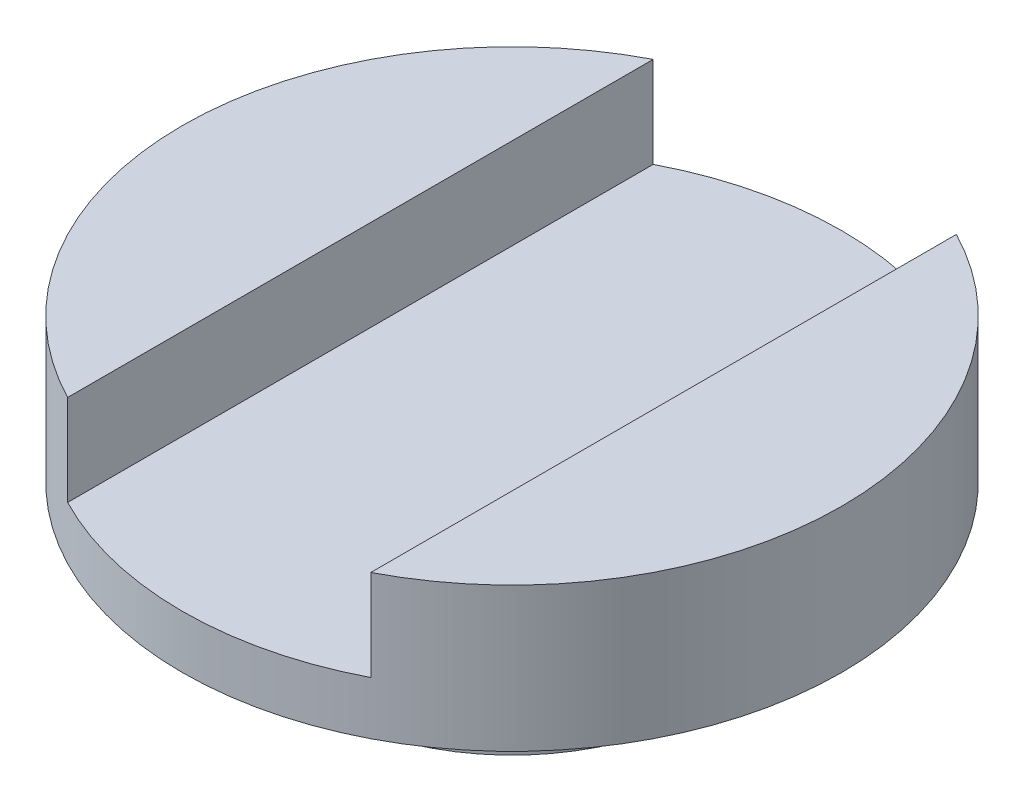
ISO-10303-21;
HEADER;
FILE_DESCRIPTION(('STEP AP214'),'2;1');
FILE_NAME('part.step','',(''),(''),'','','');
FILE_SCHEMA(('AUTOMOTIVE_DESIGN { 1 0 10303 214 1 1 1 1 }'));
ENDSEC;
DATA;
#1=APPLICATION_CONTEXT('core data for automotive mechanical design processes');
#2=APPLICATION_PROTOCOL_DEFINITION('international standard','automotive_design',2000,#1);
#3=PRODUCT_CONTEXT('',#1,'mechanical');
#4=PRODUCT('Part','Part','',(#3));
#5=PRODUCT_RELATED_PRODUCT_CATEGORY('part','',(#4));
#6=PRODUCT_DEFINITION_FORMATION('','',#4);
#7=PRODUCT_DEFINITION_CONTEXT('part definition',#1,'design');
#8=PRODUCT_DEFINITION('design','',#6,#7);
#9=PRODUCT_DEFINITION_SHAPE('','',#8);
#10=(LENGTH_UNIT() NAMED_UNIT(*) SI_UNIT(.MILLI.,.METRE.));
#11=(NAMED_UNIT(*) PLANE_ANGLE_UNIT() SI_UNIT($,.RADIAN.));
#12=(NAMED_UNIT(*) SI_UNIT($,.STERADIAN.) SOLID_ANGLE_UNIT());
#13=UNCERTAINTY_MEASURE_WITH_UNIT(LENGTH_MEASURE(1.E-05),#10,'distance_accuracy_value','');
#14=(GEOMETRIC_REPRESENTATION_CONTEXT(3) GLOBAL_UNCERTAINTY_ASSIGNED_CONTEXT((#13)) GLOBAL_UNIT_ASSIGNED_CONTEXT((#10,
#11,#12)) REPRESENTATION_CONTEXT('',''));
#15=CARTESIAN_POINT('',(0.,0.,0.));
#16=DIRECTION('',(0.,0.,1.));
#17=DIRECTION('',(1.,0.,0.));
#18=AXIS2_PLACEMENT_3D('',#15,#16,#17);
#19=CARTESIAN_POINT('',(43.5,32.25,0.));
#20=DIRECTION('',(0.,1.,0.));
#21=DIRECTION('',(0.,0.,1.));
#22=AXIS2_PLACEMENT_3D('',#19,#20,#21);
#23=PLANE('',#22);
#24=DIRECTION('',(0.,0.,1.));
#25=VECTOR('',#24,1.);
#26=CARTESIAN_POINT('',(-20.,32.25,-43.5));
#27=LINE('',#26,#25);
#28=CARTESIAN_POINT('',(-20.,32.25,-38.6296518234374));
#29=VERTEX_POINT('',#28);
#30=CARTESIAN_POINT('',(-20.,32.25,38.6296518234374));
#31=VERTEX_POINT('',#30);
#32=EDGE_CURVE('E68',#29,#31,#27,.T.);
#33=ORIENTED_EDGE('',*,*,#32,.F.);
#34=CARTESIAN_POINT('',(0.,32.25,0.));
#35=DIRECTION('',(0.,-1.,0.));
#36=DIRECTION('',(0.,0.,-1.));
#37=AXIS2_PLACEMENT_3D('',#34,#35,#36);
#38=CIRCLE('',#37,43.5);
#39=EDGE_CURVE('E114',#31,#29,#38,.T.);
#40=ORIENTED_EDGE('',*,*,#39,.F.);
#41=EDGE_LOOP('',(#33,#40));
#42=FACE_BOUND('',#41,.T.);
#43=ADVANCED_FACE('F46',(#42),#23,.T.);
#44=DIRECTION('',(0.,0.,1.));
#45=VECTOR('',#44,1.);
#46=CARTESIAN_POINT('',(20.,32.25,-43.5));
#47=LINE('',#46,#45);
#48=CARTESIAN_POINT('',(20.,32.25,-38.6296518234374));
#49=VERTEX_POINT('',#48);
#50=CARTESIAN_POINT('',(20.,32.25,38.6296518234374));
#51=VERTEX_POINT('',#50);
#52=EDGE_CURVE('E101',#49,#51,#47,.T.);
#53=ORIENTED_EDGE('',*,*,#52,.T.);
#54=EDGE_CURVE('E92',#49,#51,#38,.T.);
#55=ORIENTED_EDGE('',*,*,#54,.F.);
#56=EDGE_LOOP('',(#53,#55));
#57=FACE_BOUND('',#56,.T.);
#58=ADVANCED_FACE('F48',(#57),#23,.T.);
#59=CARTESIAN_POINT('',(0.,0.,0.));
#60=DIRECTION('',(0.,-1.,0.));
#61=DIRECTION('',(0.,0.,-1.));
#62=AXIS2_PLACEMENT_3D('',#59,#60,#61);
#63=CYLINDRICAL_SURFACE('',#62,43.5);
#64=DIRECTION('',(0.,-1.,0.));
#65=VECTOR('',#64,1.);
#66=CARTESIAN_POINT('',(-20.,0.,-38.6296518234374));
#67=LINE('',#66,#65);
#68=CARTESIAN_POINT('',(-20.,20.25,-38.6296518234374));
#69=VERTEX_POINT('',#68);
#70=EDGE_CURVE('E13',#69,#29,#67,.F.);
#71=ORIENTED_EDGE('',*,*,#70,.F.);
#72=CARTESIAN_POINT('',(0.,20.25,0.));
#73=DIRECTION('',(0.,-1.,0.));
#74=DIRECTION('',(0.,0.,-1.));
#75=AXIS2_PLACEMENT_3D('',#72,#73,#74);
#76=CIRCLE('',#75,43.5);
#77=CARTESIAN_POINT('',(20.,20.25,-38.6296518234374));
#78=VERTEX_POINT('',#77);
#79=EDGE_CURVE('E94',#78,#69,#76,.F.);
#80=ORIENTED_EDGE('',*,*,#79,.F.);
#81=DIRECTION('',(0.,-1.,0.));
#82=VECTOR('',#81,1.);
#83=CARTESIAN_POINT('',(20.,0.,-38.6296518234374));
#84=LINE('',#83,#82);
#85=EDGE_CURVE('E99',#49,#78,#84,.T.);
#86=ORIENTED_EDGE('',*,*,#85,.F.);
#87=ORIENTED_EDGE('',*,*,#54,.T.);
#88=DIRECTION('',(0.,-1.,0.));
#89=VECTOR('',#88,1.);
#90=CARTESIAN_POINT('',(20.,0.,38.6296518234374));
#91=LINE('',#90,#89);
#92=CARTESIAN_POINT('',(20.,20.25,38.6296518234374));
#93=VERTEX_POINT('',#92);
#94=EDGE_CURVE('E91',#93,#51,#91,.F.);
#95=ORIENTED_EDGE('',*,*,#94,.F.);
#96=CARTESIAN_POINT('',(-20.,20.25,38.6296518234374));
#97=VERTEX_POINT('',#96);
#98=EDGE_CURVE('E85',#97,#93,#76,.F.);
#99=ORIENTED_EDGE('',*,*,#98,.F.);
#100=DIRECTION('',(0.,-1.,0.));
#101=VECTOR('',#100,1.);
#102=CARTESIAN_POINT('',(-20.,0.,38.6296518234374));
#103=LINE('',#102,#101);
#104=EDGE_CURVE('E54',#31,#97,#103,.T.);
#105=ORIENTED_EDGE('',*,*,#104,.F.);
#106=ORIENTED_EDGE('',*,*,#39,.T.);
#107=EDGE_LOOP('',(#71,#80,#86,#87,#95,#99,#105,#106));
#108=FACE_BOUND('',#107,.T.);
#109=CARTESIAN_POINT('',(0.,13.25,0.));
#110=DIRECTION('',(0.,-1.,0.));
#111=DIRECTION('',(0.,0.,-1.));
#112=AXIS2_PLACEMENT_3D('',#109,#110,#111);
#113=CIRCLE('',#112,43.5);
#114=CARTESIAN_POINT('',(0.,13.25,-43.5));
#115=VERTEX_POINT('',#114);
#116=EDGE_CURVE('E116',#115,#115,#113,.T.);
#117=ORIENTED_EDGE('',*,*,#116,.F.);
#118=EDGE_LOOP('',(#117));
#119=FACE_BOUND('',#118,.T.);
#120=ADVANCED_FACE('F105',(#108,#119),#63,.T.);
#121=CARTESIAN_POINT('',(25.375,13.25,0.));
#122=DIRECTION('',(0.,-1.,0.));
#123=DIRECTION('',(0.,0.,-1.));
#124=AXIS2_PLACEMENT_3D('',#121,#122,#123);
#125=PLANE('',#124);
#126=ORIENTED_EDGE('',*,*,#116,.T.);
#127=EDGE_LOOP('',(#126));
#128=FACE_BOUND('',#127,.T.);
#129=CARTESIAN_POINT('',(0.,13.25,0.));
#130=DIRECTION('',(0.,-1.,0.));
#131=DIRECTION('',(0.,0.,-1.));
#132=AXIS2_PLACEMENT_3D('',#129,#130,#131);
#133=CIRCLE('',#132,25.375);
#134=CARTESIAN_POINT('',(0.,13.25,-25.375));
#135=VERTEX_POINT('',#134);
#136=EDGE_CURVE('E118',#135,#135,#133,.T.);
#137=ORIENTED_EDGE('',*,*,#136,.F.);
#138=EDGE_LOOP('',(#137));
#139=FACE_BOUND('',#138,.T.);
#140=ADVANCED_FACE('F146',(#128,#139),#125,.T.);
#141=CARTESIAN_POINT('',(0.,0.,0.));
#142=DIRECTION('',(0.,-1.,0.));
#143=DIRECTION('',(0.,0.,-1.));
#144=AXIS2_PLACEMENT_3D('',#141,#142,#143);
#145=CYLINDRICAL_SURFACE('',#144,25.375);
#146=ORIENTED_EDGE('',*,*,#136,.T.);
#147=EDGE_LOOP('',(#146));
#148=FACE_BOUND('',#147,.T.);
#149=CARTESIAN_POINT('',(0.,11.,0.));
#150=DIRECTION('',(0.,-1.,0.));
#151=DIRECTION('',(0.,0.,-1.));
#152=AXIS2_PLACEMENT_3D('',#149,#150,#151);
#153=CIRCLE('',#152,25.375);
#154=CARTESIAN_POINT('',(0.,11.,-25.375));
#155=VERTEX_POINT('',#154);
#156=EDGE_CURVE('E123',#155,#155,#153,.T.);
#157=ORIENTED_EDGE('',*,*,#156,.F.);
#158=EDGE_LOOP('',(#157));
#159=FACE_BOUND('',#158,.T.);
#160=ADVANCED_FACE('F193',(#148,#159),#145,.T.);
#161=CARTESIAN_POINT('',(22.9501288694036,11.,0.));
#162=DIRECTION('',(0.,-1.,0.));
#163=DIRECTION('',(0.,0.,-1.));
#164=AXIS2_PLACEMENT_3D('',#161,#162,#163);
#165=PLANE('',#164);
#166=ORIENTED_EDGE('',*,*,#156,.T.);
#167=EDGE_LOOP('',(#166));
#168=FACE_BOUND('',#167,.T.);
#169=CARTESIAN_POINT('',(0.,11.,0.));
#170=DIRECTION('',(0.,-1.,0.));
#171=DIRECTION('',(0.,0.,-1.));
#172=AXIS2_PLACEMENT_3D('',#169,#170,#171);
#173=CIRCLE('',#172,22.9501288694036);
#174=CARTESIAN_POINT('',(0.,11.,-22.9501288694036));
#175=VERTEX_POINT('',#174);
#176=EDGE_CURVE('E126',#175,#175,#173,.T.);
#177=ORIENTED_EDGE('',*,*,#176,.F.);
#178=EDGE_LOOP('',(#177));
#179=FACE_BOUND('',#178,.T.);
#180=ADVANCED_FACE('F189',(#168,#179),#165,.T.);
#181=CARTESIAN_POINT('',(0.,9.40000000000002,0.));
#182=DIRECTION('',(0.,-1.,0.));
#183=DIRECTION('',(0.,0.,-1.));
#184=AXIS2_PLACEMENT_3D('',#181,#182,#183);
#185=TOROIDAL_SURFACE('',#184,22.9501288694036,1.6);
#186=ORIENTED_EDGE('',*,*,#176,.T.);
#187=EDGE_LOOP('',(#186));
#188=FACE_BOUND('',#187,.T.);
#189=CARTESIAN_POINT('',(0.,8.6,0.));
#190=DIRECTION('',(0.,-1.,0.));
#191=DIRECTION('',(0.,0.,-1.));
#192=AXIS2_PLACEMENT_3D('',#189,#190,#191);
#193=CIRCLE('',#192,21.5644882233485);
#194=CARTESIAN_POINT('',(0.,8.6,-21.5644882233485));
#195=VERTEX_POINT('',#194);
#196=EDGE_CURVE('E129',#195,#195,#193,.T.);
#197=ORIENTED_EDGE('',*,*,#196,.F.);
#198=EDGE_LOOP('',(#197));
#199=FACE_BOUND('',#198,.T.);
#200=ADVANCED_FACE('F185',(#188,#199),#185,.F.);
#201=CARTESIAN_POINT('',(0.,2.,0.));
#202=DIRECTION('',(0.,-1.,0.));
#203=DIRECTION('',(0.,0.,-1.));
#204=AXIS2_PLACEMENT_3D('',#201,#202,#203);
#205=CONICAL_SURFACE('',#204,25.375,0.5235987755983);
#206=ORIENTED_EDGE('',*,*,#196,.T.);
#207=EDGE_LOOP('',(#206));
#208=FACE_BOUND('',#207,.T.);
#209=CARTESIAN_POINT('',(0.,2.,0.));
#210=DIRECTION('',(0.,-1.,0.));
#211=DIRECTION('',(0.,0.,-1.));
#212=AXIS2_PLACEMENT_3D('',#209,#210,#211);
#213=CIRCLE('',#212,25.375);
#214=CARTESIAN_POINT('',(0.,2.,-25.375));
#215=VERTEX_POINT('',#214);
#216=EDGE_CURVE('E132',#215,#215,#213,.T.);
#217=ORIENTED_EDGE('',*,*,#216,.F.);
#218=EDGE_LOOP('',(#217));
#219=FACE_BOUND('',#218,.T.);
#220=ADVANCED_FACE('F181',(#208,#219),#205,.T.);
#221=CARTESIAN_POINT('',(0.,0.,0.));
#222=DIRECTION('',(0.,-1.,0.));
#223=DIRECTION('',(0.,0.,-1.));
#224=AXIS2_PLACEMENT_3D('',#221,#222,#223);
#225=CYLINDRICAL_SURFACE('',#224,25.375);
#226=ORIENTED_EDGE('',*,*,#216,.T.);
#227=EDGE_LOOP('',(#226));
#228=FACE_BOUND('',#227,.T.);
#229=CARTESIAN_POINT('',(0.,0.,0.));
#230=DIRECTION('',(0.,-1.,0.));
#231=DIRECTION('',(0.,0.,-1.));
#232=AXIS2_PLACEMENT_3D('',#229,#230,#231);
#233=CIRCLE('',#232,25.375);
#234=CARTESIAN_POINT('',(0.,0.,-25.375));
#235=VERTEX_POINT('',#234);
#236=EDGE_CURVE('E135',#235,#235,#233,.T.);
#237=ORIENTED_EDGE('',*,*,#236,.F.);
#238=EDGE_LOOP('',(#237));
#239=FACE_BOUND('',#238,.T.);
#240=ADVANCED_FACE('F177',(#228,#239),#225,.T.);
#241=CARTESIAN_POINT('',(0.,0.,0.));
#242=DIRECTION('',(0.,-1.,0.));
#243=DIRECTION('',(0.,0.,-1.));
#244=AXIS2_PLACEMENT_3D('',#241,#242,#243);
#245=PLANE('',#244);
#246=ORIENTED_EDGE('',*,*,#236,.T.);
#247=EDGE_LOOP('',(#246));
#248=FACE_BOUND('',#247,.T.);
#249=ADVANCED_FACE('F153',(#248),#245,.T.);
#250=CARTESIAN_POINT('',(-20.,32.25,-43.5));
#251=DIRECTION('',(-1.,0.,0.));
#252=DIRECTION('',(0.,-1.,0.));
#253=AXIS2_PLACEMENT_3D('',#250,#251,#252);
#254=PLANE('',#253);
#255=ORIENTED_EDGE('',*,*,#70,.T.);
#256=ORIENTED_EDGE('',*,*,#32,.T.);
#257=ORIENTED_EDGE('',*,*,#104,.T.);
#258=DIRECTION('',(0.,0.,1.));
#259=VECTOR('',#258,1.);
#260=CARTESIAN_POINT('',(-20.,20.25,-43.5));
#261=LINE('',#260,#259);
#262=EDGE_CURVE('E88',#69,#97,#261,.T.);
#263=ORIENTED_EDGE('',*,*,#262,.F.);
#264=EDGE_LOOP('',(#255,#256,#257,#263));
#265=FACE_BOUND('',#264,.T.);
#266=ADVANCED_FACE('F111',(#265),#254,.F.);
#267=CARTESIAN_POINT('',(20.,32.25,-43.5));
#268=DIRECTION('',(1.,0.,0.));
#269=DIRECTION('',(0.,1.,0.));
#270=AXIS2_PLACEMENT_3D('',#267,#268,#269);
#271=PLANE('',#270);
#272=ORIENTED_EDGE('',*,*,#94,.T.);
#273=ORIENTED_EDGE('',*,*,#52,.F.);
#274=ORIENTED_EDGE('',*,*,#85,.T.);
#275=DIRECTION('',(0.,0.,1.));
#276=VECTOR('',#275,1.);
#277=CARTESIAN_POINT('',(20.,20.25,-43.5));
#278=LINE('',#277,#276);
#279=EDGE_CURVE('E61',#78,#93,#278,.T.);
#280=ORIENTED_EDGE('',*,*,#279,.T.);
#281=EDGE_LOOP('',(#272,#273,#274,#280));
#282=FACE_BOUND('',#281,.T.);
#283=ADVANCED_FACE('F96',(#282),#271,.F.);
#284=CARTESIAN_POINT('',(-20.,20.25,-43.5));
#285=DIRECTION('',(0.,-1.,0.));
#286=DIRECTION('',(0.,0.,-1.));
#287=AXIS2_PLACEMENT_3D('',#284,#285,#286);
#288=PLANE('',#287);
#289=ORIENTED_EDGE('',*,*,#262,.T.);
#290=ORIENTED_EDGE('',*,*,#98,.T.);
#291=ORIENTED_EDGE('',*,*,#279,.F.);
#292=ORIENTED_EDGE('',*,*,#79,.T.);
#293=EDGE_LOOP('',(#289,#290,#291,#292));
#294=FACE_BOUND('',#293,.T.);
#295=ADVANCED_FACE('F86',(#294),#288,.F.);
#296=CLOSED_SHELL('',(#43,#58,#120,#140,#160,#180,#200,#220,#240,#249,#266,#283,#295));
#297=MANIFOLD_SOLID_BREP('B2',#296);
#298=ADVANCED_BREP_SHAPE_REPRESENTATION('',(#18,#297),#14);
#299=SHAPE_DEFINITION_REPRESENTATION(#9,#298);
ENDSEC;
END-ISO-10303-21;
